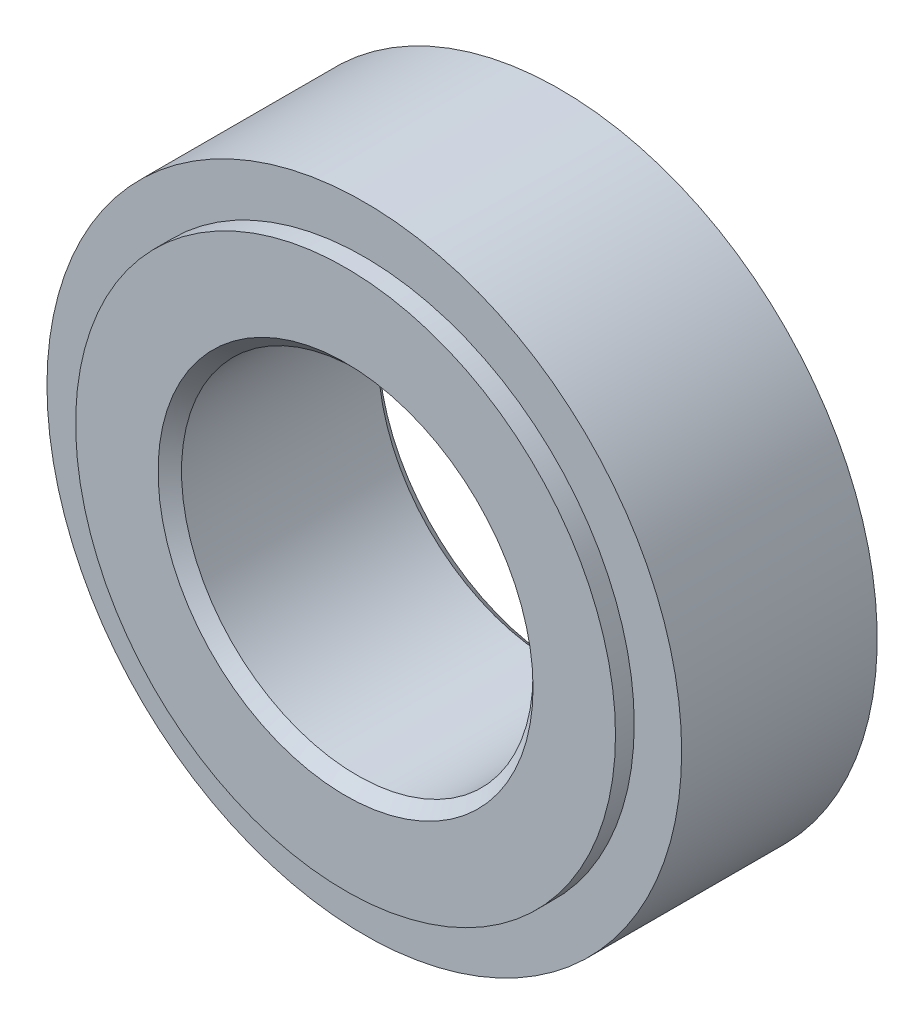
from build123d import *

# Parameters (mm, degrees)
SKETCH1_R                 = 27.1
EXTRUDE1_DEPTH            = 9.4
SKETCH2_R                 = 27.1
SKETCH2_R_2               = 23.05
CUT_EXTRUDE1_DEPTH        = 1.6
CUT_EXTRUDE2_START        = -0.5
SKETCH3_R                 = 27.1
SKETCH3_R_2               = 23.05
CUT_EXTRUDE2_DEPTH        = 0.5
SKETCH4_R                 = 15.01
CUT_EXTRUDE3_DEPTH        = 43.687937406
CHAMFER1_SIZE             = 1
M4X0_7_TAPPED_HOLE1_D     = 3.3
M4X0_7_TAPPED_HOLE1_DEPTH = 8
M4X0_7_TAPPED_HOLE1_TIP   = 0.991420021


with BuildPart() as part:
    # Sketch1 → Extrude1 (new, symmetric)
    with BuildSketch(Plane.XY):
        Circle(SKETCH1_R)
    extrude(amount=EXTRUDE1_DEPTH, both=True)

    # Sketch2 → Cut-Extrude1 (cut)
    with BuildSketch(Plane.XY.offset(9.4)):
        Circle(SKETCH2_R)
        Circle(SKETCH2_R_2, mode=Mode.SUBTRACT)
    extrude(amount=-CUT_EXTRUDE1_DEPTH, mode=Mode.SUBTRACT)

    # Sketch3 → Cut-Extrude2 (cut)
    with BuildSketch(Plane(origin=(0, 0, -9.4), x_dir=(-1, 0, 0), z_dir=(0, 0, -1)).offset(CUT_EXTRUDE2_START)):
        Circle(SKETCH3_R)
        with Locations(Location((0, 0, 0), (0, 0, 180))):
            Circle(SKETCH3_R_2, mode=Mode.SUBTRACT)
    extrude(amount=CUT_EXTRUDE2_DEPTH, mode=Mode.SUBTRACT)

    # Sketch4 → Cut-Extrude3 (cut, through all)
    with BuildSketch(Plane.XY.offset(9.4)):
        Circle(SKETCH4_R)
    extrude(amount=-CUT_EXTRUDE3_DEPTH, mode=Mode.SUBTRACT)

    # Chamfer1
    chamfer1_edges = [part.edges().sort_by_distance(p)[0] for p in [
        (-15.01, 0, -9.4),
        (-15.01, 0, 9.4),
    ]]
    chamfer(chamfer1_edges, length=CHAMFER1_SIZE)

    # M4x0.7 Tapped Hole1
    with Locations(Plane(origin=(0, 18, -9.4), x_dir=(-1, 0, 0), z_dir=(0, 0, -1))):
        with Locations((0, 0), (-18, -18), (0, -36), (18, -18)):
            Hole(M4X0_7_TAPPED_HOLE1_D / 2, depth=M4X0_7_TAPPED_HOLE1_DEPTH)
            with Locations((0, 0, -(M4X0_7_TAPPED_HOLE1_DEPTH + M4X0_7_TAPPED_HOLE1_TIP / 2))):  # 118° drill point
                Cone(0, M4X0_7_TAPPED_HOLE1_D / 2, M4X0_7_TAPPED_HOLE1_TIP, mode=Mode.SUBTRACT)


solid = part.part
